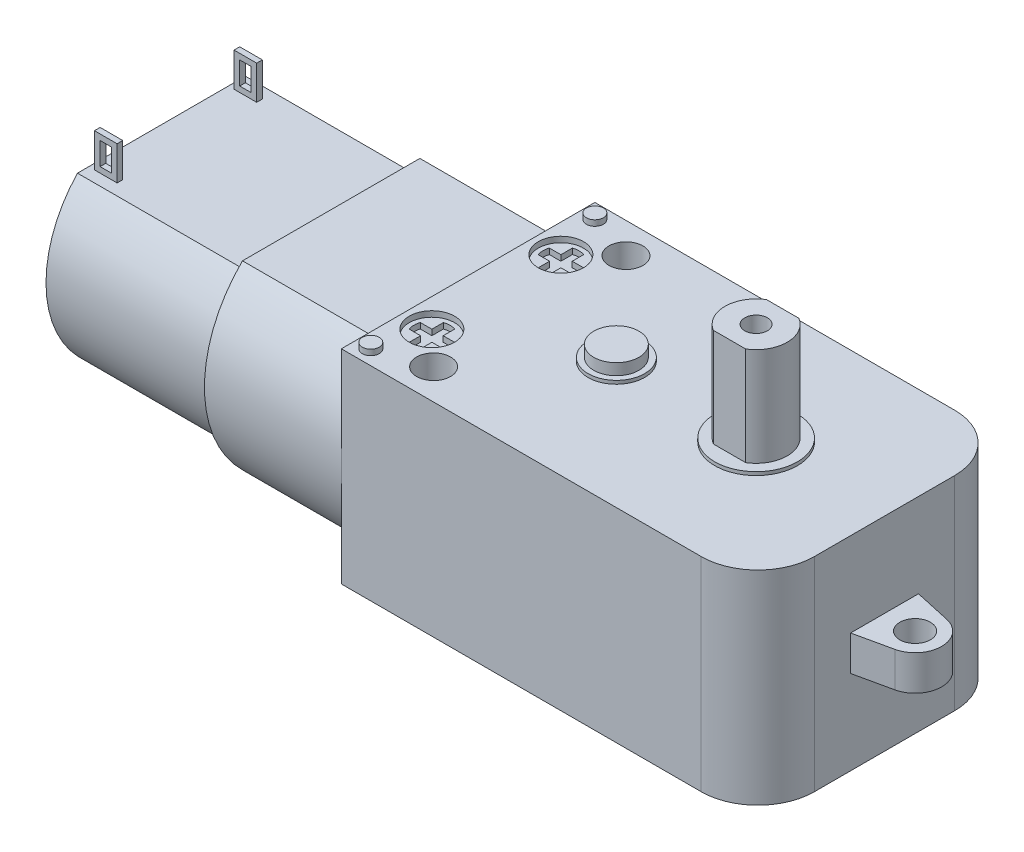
from build123d import *

# Parameters (mm, degrees)
SKETCH1_W       = 36.8
SKETCH1_H       = 22.4
EXTRUDE1_DEPTH  = 9
FILLET1_R       = 5
SKETCH2_R       = 1.35
EXTRUDE2_DEPTH  = 1.55
SKETCH3_R       = 3.65
SKETCH3_R_2     = 2.5
EXTRUDE3_DEPTH  = 0.3
SKETCH4_R       = 1
EXTRUDE4_DEPTH  = 8.7
SKETCH6_R       = 2
EXTRUDE5_DEPTH  = 1
SKETCH7_R       = 1.5
EXTRUDE6_DEPTH  = 51.765958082
SKETCH8_R       = 2
EXTRUDE7_DEPTH  = 0.5
EXTRUDE8_DEPTH  = 0.5
SKETCH10_R      = 0.75
EXTRUDE9_DEPTH  = 0.5
EXTRUDE11_DEPTH = 12.1
EXTRUDE12_DEPTH = 15
SKETCH14_R      = 4
EXTRUDE13_DEPTH = 1
SKETCH15_R      = 1
EXTRUDE14_DEPTH = 1
SKETCH16_W      = 2
SKETCH16_H      = 0.5
EXTRUDE15_DEPTH = 3
SKETCH17_W      = 1
SKETCH17_H      = 2
EXTRUDE16_DEPTH = 49.845142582


with BuildPart() as part:
    # Sketch1 → Extrude1 (new, symmetric)
    with BuildSketch(Plane(origin=(0, 0, 0), x_dir=(1, 0, 0), z_dir=(0, 1, 0))):
        with Locations((18.4, 11.2)):
            Rectangle(SKETCH1_W, SKETCH1_H)
    extrude(amount=EXTRUDE1_DEPTH, both=True)

    # Fillet1
    fillet1_edges = [part.edges().sort_by_distance(p)[0] for p in [
        (36.8, 0, -22.4),
        (36.8, 0, 0),
    ]]
    fillet(fillet1_edges, radius=FILLET1_R)

    # Sketch2 → Extrude2 (add, symmetric)
    with BuildSketch(Plane(origin=(0, 0, 0), x_dir=(1, 0, 0), z_dir=(0, 1, 0))):
        with BuildLine():
            Line((36.8, 14.2), (40.004789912, 13.495144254))
            ThreePointArc((40.004789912, 13.495144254), (41.85, 11.2), (40.004789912, 8.904855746))
            Line((40.004789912, 8.904855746), (36.8, 8.2))
            Line((36.8, 8.2), (36.8, 14.2))
        make_face()
        with Locations(Location((39.5, 11.2, 0), (0, 0, 90))):
            Circle(SKETCH2_R, mode=Mode.SUBTRACT)
    extrude(amount=EXTRUDE2_DEPTH, both=True)

    # Sketch3 → Extrude3 (add)
    with BuildSketch(Plane(origin=(0, 9, 0), x_dir=(1, 0, 0), z_dir=(0, 1, 0))):
        with Locations(Location((25.45, 11.2, 0), (0, 0, 90))):
            Circle(SKETCH3_R)
        with Locations(Location((13.1, 11.2, 0), (0, 0, 90))):
            Circle(SKETCH3_R_2)
    extrude(amount=EXTRUDE3_DEPTH)

    # Sketch4 → Extrude4 (add)
    with BuildSketch(Plane(origin=(0, 9.3, 0), x_dir=(1, 0, 0), z_dir=(0, 1, 0))):
        with BuildLine():
            Line((24.021714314, 8.85), (26.878285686, 8.85))
            ThreePointArc((26.878285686, 8.85), (28.2, 11.2), (26.878285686, 13.55))
            Line((26.878285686, 13.55), (24.021714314, 13.55))
            ThreePointArc((24.021714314, 13.55), (22.7, 11.2), (24.021714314, 8.85))
        make_face()
        with Locations(Location((25.45, 11.2, 0), (0, 0, 270))):
            Circle(SKETCH4_R, mode=Mode.SUBTRACT)
    extrude(amount=EXTRUDE4_DEPTH)

    # Sketch6 → Extrude5 (add)
    with BuildSketch(Plane(origin=(0, 9.3, 0), x_dir=(1, 0, 0), z_dir=(0, 1, 0))):
        with Locations(Location((13.1, 11.2, 0), (0, 0, 270))):
            Circle(SKETCH6_R)
    extrude(amount=EXTRUDE5_DEPTH)

    # Sketch7 → Extrude6 (cut, through all)
    with BuildSketch(Plane(origin=(0, 9, 0), x_dir=(1, 0, 0), z_dir=(0, 1, 0))):
        with Locations(Location((5.45, 19.7, 0), (0, 0, 270))):
            Circle(SKETCH7_R)
        with Locations(Location((5.45, 2.7, 0), (0, 0, 270))):
            Circle(SKETCH7_R)
    extrude(amount=-EXTRUDE6_DEPTH, mode=Mode.SUBTRACT)

    # Sketch8 → Extrude7 (cut)
    with BuildSketch(Plane(origin=(0, 9, 0), x_dir=(1, 0, 0), z_dir=(0, 1, 0))):
        with Locations(Location((2.5, 16.9, 0), (0, 0, 270))):
            Circle(SKETCH8_R)
        with Locations(Location((2.5, 5.5, 0), (0, 0, 270))):
            Circle(SKETCH8_R)
    extrude(amount=-EXTRUDE7_DEPTH, mode=Mode.SUBTRACT)

    # Sketch9 → Extrude8 (cut)
    with BuildSketch(Plane(origin=(0, 8.5, 0), x_dir=(1, 0, 0), z_dir=(0, 1, 0))):
        with BuildLine():
            Line((2, 7.019868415), (2, 6))
            Line((2, 6), (0.980131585, 6))
            ThreePointArc((0.980131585, 6), (0.9, 5.5), (0.980131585, 5))
            Line((0.980131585, 5), (2, 5))
            Line((2, 5), (2, 3.980131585))
            ThreePointArc((2, 3.980131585), (2.5, 3.9), (3, 3.980131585))
            Line((3, 3.980131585), (3, 5))
            Line((3, 5), (4.019868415, 5))
            ThreePointArc((4.019868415, 5), (4.1, 5.5), (4.019868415, 6))
            Line((4.019868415, 6), (3, 6))
            Line((3, 6), (3, 7.019868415))
            ThreePointArc((3, 7.019868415), (2.5, 7.1), (2, 7.019868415))
        make_face()
        with BuildLine():
            Line((4.019868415, 17.4), (3, 17.4))
            Line((3, 17.4), (3, 18.419868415))
            ThreePointArc((3, 18.419868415), (2.5, 18.5), (2, 18.419868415))
            Line((2, 18.419868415), (2, 17.4))
            Line((2, 17.4), (0.980131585, 17.4))
            ThreePointArc((0.980131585, 17.4), (0.9, 16.9), (0.980131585, 16.4))
            Line((0.980131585, 16.4), (2, 16.4))
            Line((2, 16.4), (2, 15.380131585))
            ThreePointArc((2, 15.380131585), (2.5, 15.3), (3, 15.380131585))
            Line((3, 15.380131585), (3, 16.4))
            Line((3, 16.4), (4.019868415, 16.4))
            ThreePointArc((4.019868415, 16.4), (4.1, 16.9), (4.019868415, 17.4))
        make_face()
    extrude(amount=-EXTRUDE8_DEPTH, mode=Mode.SUBTRACT)

    # Sketch10 → Extrude9 (add)
    with BuildSketch(Plane(origin=(0, 9, 0), x_dir=(1, 0, 0), z_dir=(0, 1, 0))):
        with Locations(Location((1.3, 21.1, 0), (0, 0, 90))):
            Circle(SKETCH10_R)
        with Locations(Location((1.3, 1.3, 0), (0, 0, 90))):
            Circle(SKETCH10_R)
    extrude(amount=EXTRUDE9_DEPTH)

    # Sketch12 → Extrude11 (add)
    with BuildSketch(Plane.ZY):
        with BuildLine():
            Line((-19.038367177, 8), (-3.361632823, 8))
            ThreePointArc((-3.361632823, 8), (0, 0), (-3.361632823, -8))
            Line((-3.361632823, -8), (-19.038367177, -8))
            ThreePointArc((-19.038367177, -8), (-22.4, 0), (-19.038367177, 8))
        make_face()
    extrude(amount=EXTRUDE11_DEPTH)

    # Sketch13 → Extrude12 (add)
    with BuildSketch(Plane.ZY.offset(12.1)):
        with BuildLine():
            Line((-18.618894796, -7), (-3.781105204, -7))
            ThreePointArc((-3.781105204, -7), (-1, 0), (-3.781105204, 7))
            Line((-3.781105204, 7), (-18.618894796, 7))
            ThreePointArc((-18.618894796, 7), (-21.4, 0), (-18.618894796, -7))
        make_face()
    extrude(amount=EXTRUDE12_DEPTH)

    # Sketch14 → Extrude13 (add)
    with BuildSketch(Plane.ZY.offset(27.1)):
        with Locations((-11.2, 0)):
            Circle(SKETCH14_R)
    extrude(amount=EXTRUDE13_DEPTH)

    # Sketch15 → Extrude14 (add)
    with BuildSketch(Plane.ZY.offset(28.1)):
        with Locations((-11.2, 0)):
            Circle(SKETCH15_R)
    extrude(amount=EXTRUDE14_DEPTH)

    # Sketch16 → Extrude15 (add)
    with BuildSketch(Plane(origin=(0, 7, 0), x_dir=(1, 0, 0), z_dir=(0, 1, 0))):
        with Locations((-25.6, 17.368894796)):
            Rectangle(SKETCH16_W, SKETCH16_H)
        with Locations((-25.6, 5.031105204)):
            Rectangle(SKETCH16_W, SKETCH16_H)
    extrude(amount=EXTRUDE15_DEPTH)

    # Sketch17 → Extrude16 (cut, through all)
    with BuildSketch(Plane.XY.offset(-4.781105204)):
        with Locations((-25.6, 8.5)):
            Rectangle(SKETCH17_W, SKETCH17_H)
    extrude(amount=-EXTRUDE16_DEPTH, mode=Mode.SUBTRACT)


solid = part.part
